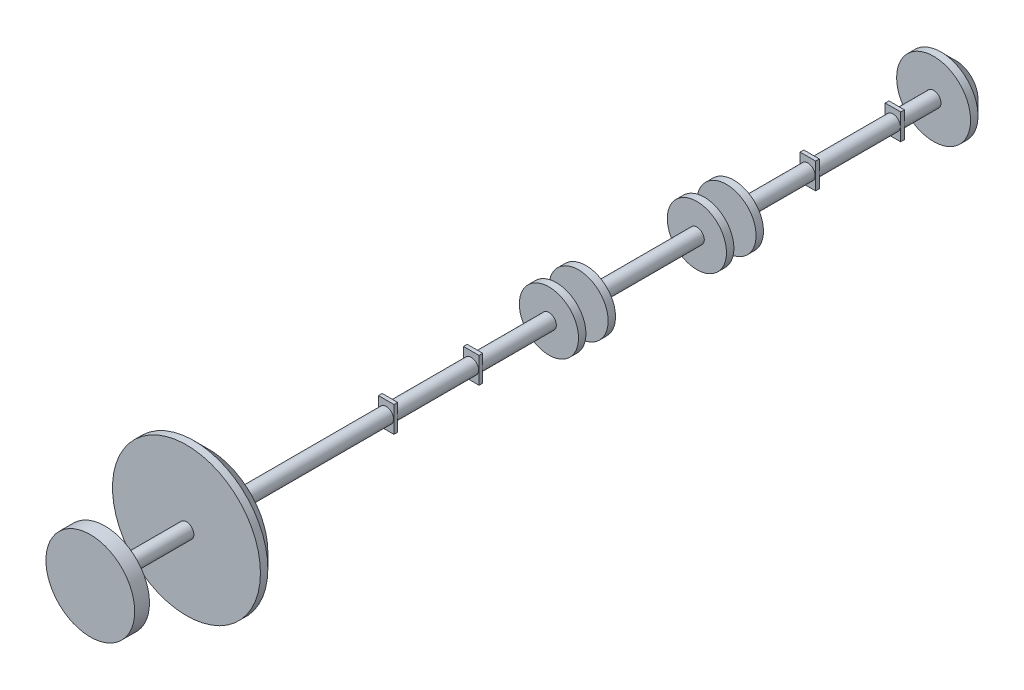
from build123d import *

# Parameters (mm, degrees)
ESQUISSE1_R                  = 10
EXTRUSION1_DEPTH             = 240
ESQUISSE2_W                  = 21
ESQUISSE2_H                  = 35
EXTRUSION2_DEPTH             = 5
EXTRUSION3_START             = 110
ESQUISSE3_R                  = 10
EXTRUSION3_DEPTH             = 110
ESQUISSE4_W                  = 21
ESQUISSE4_H                  = 35
EXTRUSION4_DEPTH             = 5
EXTRUSION5_START             = 100
ESQUISSE5_R                  = 10
EXTRUSION5_DEPTH             = 100
ESQUISSE7_R                  = 100
EXTRUSION7_DEPTH             = 30
ESQUISSE10_R                 = 10
EXTRUSION8_DEPTH             = 110
ESQUISSE11_R                 = 60
EXTRUSION9_DEPTH             = 20
ESQUISSE12_R                 = 40
EXTRUSION10_DEPTH            = 10
EXTRUSION11_START            = 30
ESQUISSE13_R                 = 10
EXTRUSION11_DEPTH            = 30
ESQUISSE14_R                 = 40
EXTRUSION12_DEPTH            = 10
EXTRUSION13_START            = 150
ESQUISSE15_R                 = 10
EXTRUSION13_DEPTH            = 150
ESQUISSE16_R                 = 40
EXTRUSION14_DEPTH            = 10
EXTRUSION15_START            = 30
ESQUISSE17_R                 = 10
EXTRUSION15_DEPTH            = 30
ESQUISSE18_R                 = 40
EXTRUSION16_DEPTH            = 10
EXTRUSION17_START            = 100
ESQUISSE19_R                 = 10
EXTRUSION17_DEPTH            = 100
ESQUISSE20_W                 = 21
ESQUISSE20_H                 = 35
EXTRUSION18_DEPTH            = 5
EXTRUSION19_START            = 110
ESQUISSE21_R                 = 10
EXTRUSION19_DEPTH            = 110
ESQUISSE22_W                 = 21
ESQUISSE22_H                 = 35
EXTRUSION20_DEPTH            = 5
EXTRUSION21_START            = 50
ESQUISSE23_R                 = 10
EXTRUSION21_DEPTH            = 50
ESQUISSE24_R                 = 50
EXTRUSION22_DEPTH            = 30
CHANFREIN3_SIZE              = 20
ENL_V_MAT_EXTRU_1_DEPTH      = 783.879301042
ENL_V_MAT_EXTRU_1_DEPTH_BACK = 783.879301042
ESQUISSE25_W                 = 80
ESQUISSE25_H                 = 30
CHANFREIN4_SIZE              = 20


with BuildPart() as part:
    # Esquisse1 → Extrusion1 (new body)
    with BuildSketch(Plane.XY):
        Circle(ESQUISSE1_R)
    extrude(amount=EXTRUSION1_DEPTH)

    # Esquisse2 → Extrusion2 (add)
    with BuildSketch(Plane(origin=(0, 0, 0), x_dir=(-1, 0, 0), z_dir=(0, 0, -1))):
        Rectangle(ESQUISSE2_W, ESQUISSE2_H)
    extrude(amount=EXTRUSION2_DEPTH)

    # Esquisse3 → Extrusion3 (add)
    with BuildSketch(Plane(origin=(0, 0, -5), x_dir=(-1, 0, 0), z_dir=(0, 0, -1)).offset(EXTRUSION3_START)):
        Circle(ESQUISSE3_R)
    extrude(amount=-EXTRUSION3_DEPTH)

    # Esquisse4 → Extrusion4 (add)
    with BuildSketch(Plane(origin=(0, 0, -115), x_dir=(-1, 0, 0), z_dir=(0, 0, -1))):
        Rectangle(ESQUISSE4_W, ESQUISSE4_H)
    extrude(amount=EXTRUSION4_DEPTH)

    # Esquisse5 → Extrusion5 (add)
    with BuildSketch(Plane(origin=(0, 0, -120), x_dir=(-1, 0, 0), z_dir=(0, 0, -1)).offset(EXTRUSION5_START)):
        Circle(ESQUISSE5_R)
    extrude(amount=-EXTRUSION5_DEPTH)

    # Esquisse7 → Extrusion7 (add)
    with BuildSketch(Plane.XY.offset(240)):
        Circle(ESQUISSE7_R)
    extrude(amount=EXTRUSION7_DEPTH)

    # Esquisse10 → Extrusion8 (add)
    with BuildSketch(Plane.XY.offset(270)):
        with Locations(Location((0, 0, 0), (0, 0, 180))):
            Circle(ESQUISSE10_R)
    extrude(amount=EXTRUSION8_DEPTH)

    # Esquisse11 → Extrusion9 (add)
    with BuildSketch(Plane.XY.offset(380)):
        Circle(ESQUISSE11_R)
    extrude(amount=EXTRUSION9_DEPTH)

    # Esquisse12 → Extrusion10 (add)
    with BuildSketch(Plane(origin=(0, 0, -220), x_dir=(-1, 0, 0), z_dir=(0, 0, -1))):
        Circle(ESQUISSE12_R)
    extrude(amount=EXTRUSION10_DEPTH)

    # Esquisse13 → Extrusion11 (add)
    with BuildSketch(Plane(origin=(0, 0, -230), x_dir=(-1, 0, 0), z_dir=(0, 0, -1)).offset(EXTRUSION11_START)):
        Circle(ESQUISSE13_R)
    extrude(amount=-EXTRUSION11_DEPTH)

    # Esquisse14 → Extrusion12 (add)
    with BuildSketch(Plane(origin=(0, 0, -260), x_dir=(-1, 0, 0), z_dir=(0, 0, -1))):
        Circle(ESQUISSE14_R)
    extrude(amount=EXTRUSION12_DEPTH)

    # Esquisse15 → Extrusion13 (add)
    with BuildSketch(Plane(origin=(0, 0, -270), x_dir=(-1, 0, 0), z_dir=(0, 0, -1)).offset(EXTRUSION13_START)):
        Circle(ESQUISSE15_R)
    extrude(amount=-EXTRUSION13_DEPTH)

    # Esquisse16 → Extrusion14 (add)
    with BuildSketch(Plane(origin=(0, 0, -420), x_dir=(-1, 0, 0), z_dir=(0, 0, -1))):
        Circle(ESQUISSE16_R)
    extrude(amount=EXTRUSION14_DEPTH)

    # Esquisse17 → Extrusion15 (add)
    with BuildSketch(Plane(origin=(0, 0, -430), x_dir=(-1, 0, 0), z_dir=(0, 0, -1)).offset(EXTRUSION15_START)):
        Circle(ESQUISSE17_R)
    extrude(amount=-EXTRUSION15_DEPTH)

    # Esquisse18 → Extrusion16 (add)
    with BuildSketch(Plane(origin=(0, 0, -460), x_dir=(-1, 0, 0), z_dir=(0, 0, -1))):
        Circle(ESQUISSE18_R)
    extrude(amount=EXTRUSION16_DEPTH)

    # Esquisse19 → Extrusion17 (add)
    with BuildSketch(Plane(origin=(0, 0, -470), x_dir=(-1, 0, 0), z_dir=(0, 0, -1)).offset(EXTRUSION17_START)):
        Circle(ESQUISSE19_R)
    extrude(amount=-EXTRUSION17_DEPTH)

    # Esquisse20 → Extrusion18 (add)
    with BuildSketch(Plane(origin=(0, 0, -570), x_dir=(-1, 0, 0), z_dir=(0, 0, -1))):
        Rectangle(ESQUISSE20_W, ESQUISSE20_H)
    extrude(amount=EXTRUSION18_DEPTH)

    # Esquisse21 → Extrusion19 (add)
    with BuildSketch(Plane(origin=(0, 0, -575), x_dir=(-1, 0, 0), z_dir=(0, 0, -1)).offset(EXTRUSION19_START)):
        Circle(ESQUISSE21_R)
    extrude(amount=-EXTRUSION19_DEPTH)

    # Esquisse22 → Extrusion20 (add)
    with BuildSketch(Plane(origin=(0, 0, -685), x_dir=(-1, 0, 0), z_dir=(0, 0, -1))):
        Rectangle(ESQUISSE22_W, ESQUISSE22_H)
    extrude(amount=EXTRUSION20_DEPTH)

    # Esquisse23 → Extrusion21 (add)
    with BuildSketch(Plane(origin=(0, 0, -690), x_dir=(-1, 0, 0), z_dir=(0, 0, -1)).offset(EXTRUSION21_START)):
        Circle(ESQUISSE23_R)
    extrude(amount=-EXTRUSION21_DEPTH)

    # Esquisse24 → Extrusion22 (add)
    with BuildSketch(Plane(origin=(0, 0, -740), x_dir=(-1, 0, 0), z_dir=(0, 0, -1))):
        Circle(ESQUISSE24_R)
    extrude(amount=EXTRUSION22_DEPTH)

    # Chanfrein3
    chanfrein3_edges = [part.edges().sort_by_distance(p)[0] for p in [
        (50, 0, -770),
    ]]
    chamfer(chanfrein3_edges, length=CHANFREIN3_SIZE)

    # Esquisse25 → Enl_v. mat.-Extru.1 (cut, two sides: drawn at the far end of the back side and taken through both)
    with BuildSketch(Plane(origin=(0, 0, 0), x_dir=(1, 0, 0), z_dir=(0, 1, 0)).offset(-ENL_V_MAT_EXTRU_1_DEPTH_BACK)):
        with Locations((0, 445)):
            Rectangle(ESQUISSE25_W, ESQUISSE25_H)
        with Locations((0, 245)):
            Rectangle(ESQUISSE25_W, ESQUISSE25_H)
    extrude(amount=ENL_V_MAT_EXTRU_1_DEPTH + ENL_V_MAT_EXTRU_1_DEPTH_BACK, mode=Mode.SUBTRACT)


with BuildPart() as enl_v_mat_extru_1_piece_1:
    # of the separate pieces the step leaves, piece 1, a body of its own (enl_v_mat_extru_1_pieces)
    add(part.part.solids().sort_by_distance((-40, 0, -230))[0])

    # Chanfrein4
    chanfrein4_edges = [enl_v_mat_extru_1_piece_1.edges().sort_by_distance(p)[0] for p in [
        (-100, 0, 240),
    ]]
    chamfer(chanfrein4_edges, length=CHANFREIN4_SIZE)


with BuildPart() as enl_v_mat_extru_1_piece_2:
    # of the separate pieces the step leaves, piece 2, a body of its own (enl_v_mat_extru_1_pieces)
    add(part.part.solids().sort_by_distance((-50, 0, -750))[0])


with BuildPart() as enl_v_mat_extru_1_piece_3:
    # of the separate pieces the step leaves, piece 3, a body of its own (enl_v_mat_extru_1_pieces)
    add(part.part.solids().sort_by_distance((-40, 0, -430))[0])


solid = Compound([enl_v_mat_extru_1_piece_1.part, enl_v_mat_extru_1_piece_2.part, enl_v_mat_extru_1_piece_3.part])
